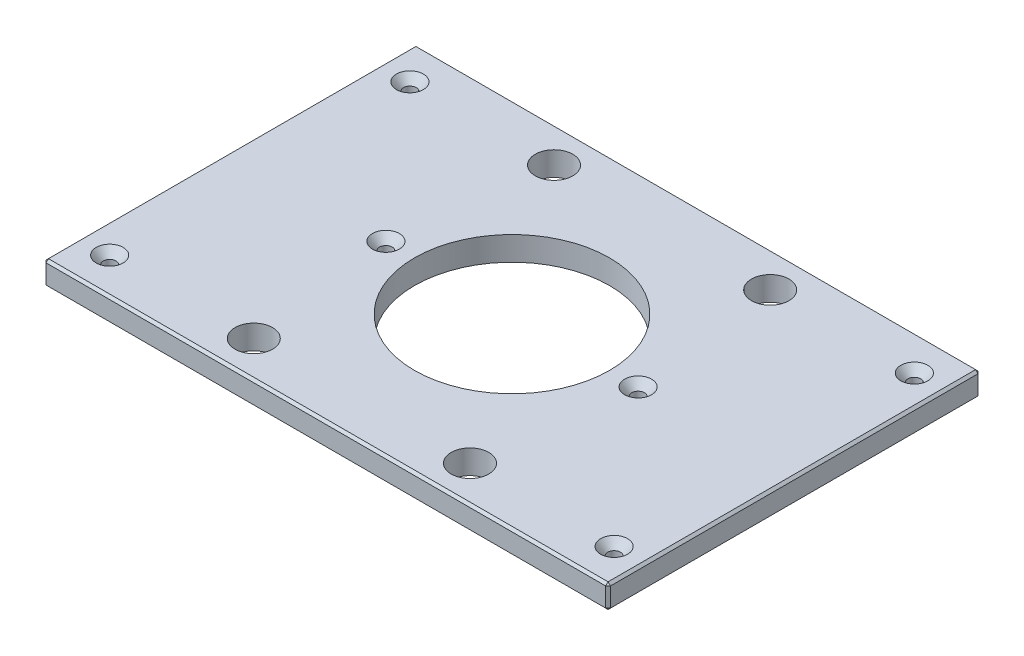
from build123d import *

# Parameters (mm, degrees)
SKETCH1_W                                        = 298.45
SKETCH1_H                                        = 196.85
BOSS_EXTRUDE1_DEPTH                              = 12.7
SKETCH13_R                                       = 51.562
CUT_EXTRUDE6_DEPTH                               = 180.211805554
F_25_32_0_78125_DIAMETER_HOLE1_D                 = 19.84375
CHAMFER2_SIZE                                    = 1.27
CSK_FOR_1_4_FLAT_HEAD_MACHINE_SCREW1_D           = 6.7564
CSK_FOR_1_4_FLAT_HEAD_MACHINE_SCREW1_CSINK_D     = 14.2748
CSK_FOR_1_4_FLAT_HEAD_MACHINE_SCREW1_CSINK_ANGLE = 82


with BuildPart() as part:
    # Sketch1 → Boss-Extrude1 (new body)
    with BuildSketch(Plane(origin=(0, 0, 0), x_dir=(1, 0, 0), z_dir=(0, 1, 0))):
        Rectangle(SKETCH1_W, SKETCH1_H)
    extrude(amount=BOSS_EXTRUDE1_DEPTH)

    # Sketch13 → Cut-Extrude6 (cut, through all)
    with BuildSketch(Plane(origin=(0, 12.7, 0), x_dir=(1, 0, 0), z_dir=(0, 1, 0))):
        with Locations(Location((0, 0, 0), (0, 0, 270))):
            Circle(SKETCH13_R)
    extrude(amount=-CUT_EXTRUDE6_DEPTH, mode=Mode.SUBTRACT)

    # 25_32 _0.78125_ Diameter Hole1 (through all)
    with Locations(Plane(origin=(0, 12.7, 0), x_dir=(1, 0, 0), z_dir=(0, 1, 0))):
        with Locations((57.15, 79.375), (-57.15, 79.375), (57.15, -79.375), (-57.15, -79.375)):
            Hole(F_25_32_0_78125_DIAMETER_HOLE1_D / 2)

    # Chamfer2
    chamfer2_edges = [part.edges().sort_by_distance(p)[0] for p in [
        (149.225, 12.7, 0),
        (0, 12.7, -98.425),
        (-149.225, 12.7, 0),
        (0, 0, -98.425),
        (149.225, 0, 0),
        (0, 0, 98.425),
        (-149.225, 0, 0),
        (0, 12.7, 98.425),
        (-149.225, 6.35, -98.425),
        (149.225, 6.35, -98.425),
        (149.225, 6.35, 98.425),
        (-149.225, 6.35, 98.425),
    ]]
    chamfer(chamfer2_edges, length=CHAMFER2_SIZE)

    # CSK for 1_4 Flat Head Machine Screw1 (through all)
    with Locations(Plane(origin=(0, 12.7, 0), x_dir=(1, 0, 0), z_dir=(0, 1, 0))):
        with Locations((133.35, 79.375), (133.35, -79.375), (-133.35, -79.375), (-66.675, 0), (66.675, 0), (-133.35, 79.375), (-57.15, 79.375), (-57.15, -79.375)):
            CounterSinkHole(CSK_FOR_1_4_FLAT_HEAD_MACHINE_SCREW1_D / 2, CSK_FOR_1_4_FLAT_HEAD_MACHINE_SCREW1_CSINK_D / 2, counter_sink_angle=CSK_FOR_1_4_FLAT_HEAD_MACHINE_SCREW1_CSINK_ANGLE)


solid = part.part
